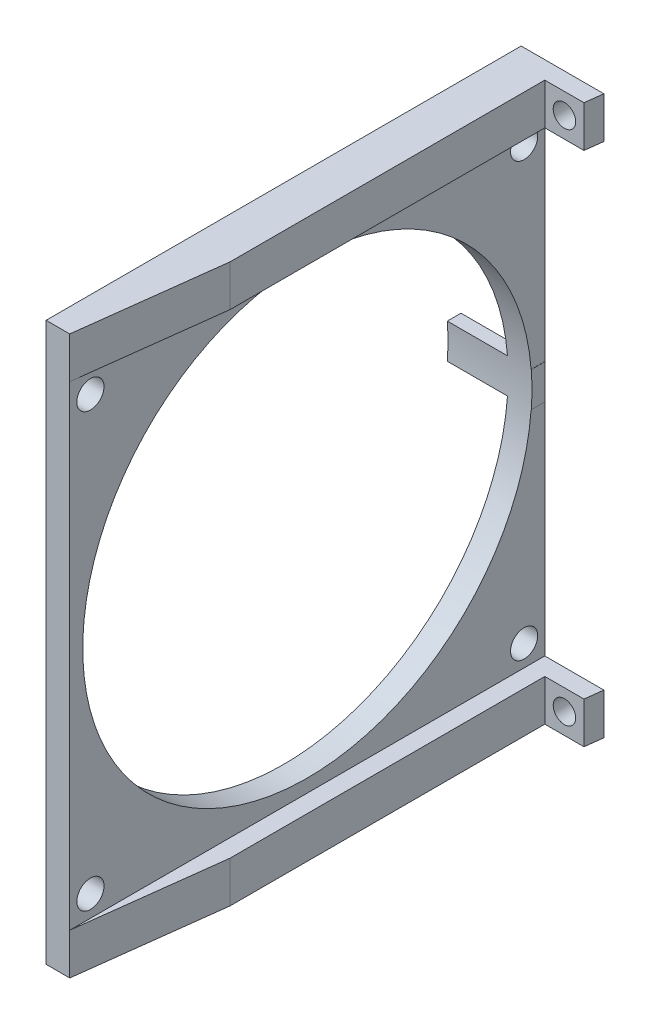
ISO-10303-21;
HEADER;
FILE_DESCRIPTION(('STEP AP214'),'2;1');
FILE_NAME('part.step','',(''),(''),'','','');
FILE_SCHEMA(('AUTOMOTIVE_DESIGN { 1 0 10303 214 1 1 1 1 }'));
ENDSEC;
DATA;
#1=APPLICATION_CONTEXT('core data for automotive mechanical design processes');
#2=APPLICATION_PROTOCOL_DEFINITION('international standard','automotive_design',2000,#1);
#3=PRODUCT_CONTEXT('',#1,'mechanical');
#4=PRODUCT('Part','Part','',(#3));
#5=PRODUCT_RELATED_PRODUCT_CATEGORY('part','',(#4));
#6=PRODUCT_DEFINITION_FORMATION('','',#4);
#7=PRODUCT_DEFINITION_CONTEXT('part definition',#1,'design');
#8=PRODUCT_DEFINITION('design','',#6,#7);
#9=PRODUCT_DEFINITION_SHAPE('','',#8);
#10=(LENGTH_UNIT() NAMED_UNIT(*) SI_UNIT(.MILLI.,.METRE.));
#11=(NAMED_UNIT(*) PLANE_ANGLE_UNIT() SI_UNIT($,.RADIAN.));
#12=(NAMED_UNIT(*) SI_UNIT($,.STERADIAN.) SOLID_ANGLE_UNIT());
#13=UNCERTAINTY_MEASURE_WITH_UNIT(LENGTH_MEASURE(1.E-05),#10,'distance_accuracy_value','');
#14=(GEOMETRIC_REPRESENTATION_CONTEXT(3) GLOBAL_UNCERTAINTY_ASSIGNED_CONTEXT((#13)) GLOBAL_UNIT_ASSIGNED_CONTEXT((#10,
#11,#12)) REPRESENTATION_CONTEXT('',''));
#15=CARTESIAN_POINT('',(0.,0.,0.));
#16=DIRECTION('',(0.,0.,1.));
#17=DIRECTION('',(1.,0.,0.));
#18=AXIS2_PLACEMENT_3D('',#15,#16,#17);
#19=CARTESIAN_POINT('',(4.,-7.60000000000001,0.));
#20=DIRECTION('',(-0.992353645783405,0.,-0.12342707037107));
#21=DIRECTION('',(-0.12342707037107,0.,0.992353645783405));
#22=AXIS2_PLACEMENT_3D('',#19,#20,#21);
#23=PLANE('',#22);
#24=DIRECTION('',(0.12342707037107,0.,-0.992353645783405));
#25=VECTOR('',#24,1.);
#26=CARTESIAN_POINT('',(14.,80.4,-80.4));
#27=LINE('',#26,#25);
#28=CARTESIAN_POINT('',(4.,80.4,0.));
#29=VERTEX_POINT('',#28);
#30=CARTESIAN_POINT('',(7.,80.4,-24.12));
#31=VERTEX_POINT('',#30);
#32=EDGE_CURVE('E201',#29,#31,#27,.T.);
#33=ORIENTED_EDGE('',*,*,#32,.T.);
#34=DIRECTION('',(0.,1.,0.));
#35=VECTOR('',#34,1.);
#36=CARTESIAN_POINT('',(7.,-7.60000000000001,-24.12));
#37=LINE('',#36,#35);
#38=CARTESIAN_POINT('',(7.,87.4,-24.12));
#39=VERTEX_POINT('',#38);
#40=EDGE_CURVE('E187',#31,#39,#37,.T.);
#41=ORIENTED_EDGE('',*,*,#40,.T.);
#42=DIRECTION('',(-0.12342707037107,0.,0.992353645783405));
#43=VECTOR('',#42,1.);
#44=CARTESIAN_POINT('',(4.,87.4,0.));
#45=LINE('',#44,#43);
#46=CARTESIAN_POINT('',(4.,87.4,0.));
#47=VERTEX_POINT('',#46);
#48=EDGE_CURVE('E198',#39,#47,#45,.T.);
#49=ORIENTED_EDGE('',*,*,#48,.T.);
#50=DIRECTION('',(0.,1.,0.));
#51=VECTOR('',#50,1.);
#52=CARTESIAN_POINT('',(4.,-7.60000000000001,0.));
#53=LINE('',#52,#51);
#54=EDGE_CURVE('E212',#29,#47,#53,.T.);
#55=ORIENTED_EDGE('',*,*,#54,.F.);
#56=EDGE_LOOP('',(#33,#41,#49,#55));
#57=FACE_BOUND('',#56,.T.);
#58=ADVANCED_FACE('F39',(#57),#23,.F.);
#59=DIRECTION('',(0.12342707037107,0.,-0.992353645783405));
#60=VECTOR('',#59,1.);
#61=CARTESIAN_POINT('',(14.,-7.,-80.4));
#62=LINE('',#61,#60);
#63=CARTESIAN_POINT('',(4.,-7.,0.));
#64=VERTEX_POINT('',#63);
#65=CARTESIAN_POINT('',(7.,-7.,-24.12));
#66=VERTEX_POINT('',#65);
#67=EDGE_CURVE('E223',#64,#66,#62,.T.);
#68=ORIENTED_EDGE('',*,*,#67,.T.);
#69=CARTESIAN_POINT('',(7.,0.,-24.12));
#70=VERTEX_POINT('',#69);
#71=EDGE_CURVE('E202',#66,#70,#37,.T.);
#72=ORIENTED_EDGE('',*,*,#71,.T.);
#73=DIRECTION('',(-0.12342707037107,0.,0.992353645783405));
#74=VECTOR('',#73,1.);
#75=CARTESIAN_POINT('',(14.,0.,-80.4));
#76=LINE('',#75,#74);
#77=CARTESIAN_POINT('',(4.,0.,0.));
#78=VERTEX_POINT('',#77);
#79=EDGE_CURVE('E226',#70,#78,#76,.T.);
#80=ORIENTED_EDGE('',*,*,#79,.T.);
#81=EDGE_CURVE('E219',#64,#78,#53,.T.);
#82=ORIENTED_EDGE('',*,*,#81,.F.);
#83=EDGE_LOOP('',(#68,#72,#80,#82));
#84=FACE_BOUND('',#83,.T.);
#85=ADVANCED_FACE('F387',(#84),#23,.F.);
#86=CARTESIAN_POINT('',(4.02460480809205,43.1464966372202,-76.4));
#87=DIRECTION('',(0.,-1.,0.));
#88=DIRECTION('',(0.,0.,-1.));
#89=AXIS2_PLACEMENT_3D('',#86,#87,#88);
#90=PLANE('',#89);
#91=DIRECTION('',(-1.,0.,0.));
#92=VECTOR('',#91,1.);
#93=CARTESIAN_POINT('',(8.,43.1464966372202,-78.0855930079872));
#94=LINE('',#93,#92);
#95=CARTESIAN_POINT('',(4.02460480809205,43.1464966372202,-78.0855930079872));
#96=VERTEX_POINT('',#95);
#97=CARTESIAN_POINT('',(4.,43.1464966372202,-78.0855930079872));
#98=VERTEX_POINT('',#97);
#99=EDGE_CURVE('E271',#96,#98,#94,.T.);
#100=ORIENTED_EDGE('',*,*,#99,.F.);
#101=DIRECTION('',(0.,0.,-1.));
#102=VECTOR('',#101,1.);
#103=CARTESIAN_POINT('',(4.02460480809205,43.1464966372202,-76.4));
#104=LINE('',#103,#102);
#105=CARTESIAN_POINT('',(4.02460480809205,43.1464966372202,-80.4));
#106=VERTEX_POINT('',#105);
#107=EDGE_CURVE('E305',#96,#106,#104,.T.);
#108=ORIENTED_EDGE('',*,*,#107,.T.);
#109=DIRECTION('',(-1.,0.,0.));
#110=VECTOR('',#109,1.);
#111=CARTESIAN_POINT('',(4.02460480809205,43.1464966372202,-80.4));
#112=LINE('',#111,#110);
#113=CARTESIAN_POINT('',(4.,43.1464966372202,-80.4));
#114=VERTEX_POINT('',#113);
#115=EDGE_CURVE('E296',#106,#114,#112,.T.);
#116=ORIENTED_EDGE('',*,*,#115,.T.);
#117=DIRECTION('',(0.,0.,1.));
#118=VECTOR('',#117,1.);
#119=CARTESIAN_POINT('',(4.,43.1464966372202,0.));
#120=LINE('',#119,#118);
#121=EDGE_CURVE('E304',#114,#98,#120,.T.);
#122=ORIENTED_EDGE('',*,*,#121,.T.);
#123=EDGE_LOOP('',(#100,#108,#116,#122));
#124=FACE_BOUND('',#123,.T.);
#125=ADVANCED_FACE('F383',(#124),#90,.F.);
#126=CARTESIAN_POINT('',(4.02460480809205,37.2535033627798,-76.4));
#127=DIRECTION('',(0.,-1.,0.));
#128=DIRECTION('',(0.,0.,-1.));
#129=AXIS2_PLACEMENT_3D('',#126,#127,#128);
#130=PLANE('',#129);
#131=DIRECTION('',(0.,0.,-1.));
#132=VECTOR('',#131,1.);
#133=CARTESIAN_POINT('',(4.02460480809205,37.2535033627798,-76.4));
#134=LINE('',#133,#132);
#135=CARTESIAN_POINT('',(4.02460480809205,37.2535033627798,-78.0855930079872));
#136=VERTEX_POINT('',#135);
#137=CARTESIAN_POINT('',(4.02460480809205,37.2535033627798,-80.4));
#138=VERTEX_POINT('',#137);
#139=EDGE_CURVE('E302',#136,#138,#134,.T.);
#140=ORIENTED_EDGE('',*,*,#139,.F.);
#141=DIRECTION('',(-1.,0.,0.));
#142=VECTOR('',#141,1.);
#143=CARTESIAN_POINT('',(8.,37.2535033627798,-78.0855930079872));
#144=LINE('',#143,#142);
#145=CARTESIAN_POINT('',(4.,37.2535033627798,-78.0855930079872));
#146=VERTEX_POINT('',#145);
#147=EDGE_CURVE('E263',#136,#146,#144,.T.);
#148=ORIENTED_EDGE('',*,*,#147,.T.);
#149=DIRECTION('',(0.,0.,1.));
#150=VECTOR('',#149,1.);
#151=CARTESIAN_POINT('',(4.,37.2535033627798,0.));
#152=LINE('',#151,#150);
#153=CARTESIAN_POINT('',(4.,37.2535033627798,-80.4));
#154=VERTEX_POINT('',#153);
#155=EDGE_CURVE('E314',#154,#146,#152,.T.);
#156=ORIENTED_EDGE('',*,*,#155,.F.);
#157=DIRECTION('',(-1.,0.,0.));
#158=VECTOR('',#157,1.);
#159=CARTESIAN_POINT('',(4.02460480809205,37.2535033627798,-80.4));
#160=LINE('',#159,#158);
#161=EDGE_CURVE('E290',#138,#154,#160,.T.);
#162=ORIENTED_EDGE('',*,*,#161,.F.);
#163=EDGE_LOOP('',(#140,#148,#156,#162));
#164=FACE_BOUND('',#163,.T.);
#165=ADVANCED_FACE('F456',(#164),#130,.T.);
#166=DIRECTION('',(0.,0.,-1.));
#167=VECTOR('',#166,1.);
#168=CARTESIAN_POINT('',(0.,37.2535033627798,0.));
#169=LINE('',#168,#167);
#170=CARTESIAN_POINT('',(0.,37.2535033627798,-78.0855930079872));
#171=VERTEX_POINT('',#170);
#172=CARTESIAN_POINT('',(0.,37.2535033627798,-80.4));
#173=VERTEX_POINT('',#172);
#174=EDGE_CURVE('E317',#171,#173,#169,.T.);
#175=ORIENTED_EDGE('',*,*,#174,.F.);
#176=DIRECTION('',(-1.,0.,0.));
#177=VECTOR('',#176,1.);
#178=CARTESIAN_POINT('',(8.,37.2535033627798,-78.0855930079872));
#179=LINE('',#178,#177);
#180=CARTESIAN_POINT('',(-10.1882602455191,37.2535033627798,-78.0855930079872));
#181=VERTEX_POINT('',#180);
#182=EDGE_CURVE('E258',#171,#181,#179,.T.);
#183=ORIENTED_EDGE('',*,*,#182,.T.);
#184=DIRECTION('',(0.,0.,-1.));
#185=VECTOR('',#184,1.);
#186=CARTESIAN_POINT('',(-10.1882602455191,37.2535033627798,-76.4));
#187=LINE('',#186,#185);
#188=CARTESIAN_POINT('',(-10.1882602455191,37.2535033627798,-80.4));
#189=VERTEX_POINT('',#188);
#190=EDGE_CURVE('E301',#181,#189,#187,.T.);
#191=ORIENTED_EDGE('',*,*,#190,.T.);
#192=EDGE_CURVE('E289',#173,#189,#160,.T.);
#193=ORIENTED_EDGE('',*,*,#192,.F.);
#194=EDGE_LOOP('',(#175,#183,#191,#193));
#195=FACE_BOUND('',#194,.T.);
#196=ADVANCED_FACE('F380',(#195),#130,.T.);
#197=DIRECTION('',(-1.,0.,0.));
#198=VECTOR('',#197,1.);
#199=CARTESIAN_POINT('',(8.,43.1464966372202,-78.0855930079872));
#200=LINE('',#199,#198);
#201=CARTESIAN_POINT('',(0.,43.1464966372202,-78.0855930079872));
#202=VERTEX_POINT('',#201);
#203=CARTESIAN_POINT('',(-10.1882602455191,43.1464966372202,-78.0855930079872));
#204=VERTEX_POINT('',#203);
#205=EDGE_CURVE('E252',#202,#204,#200,.T.);
#206=ORIENTED_EDGE('',*,*,#205,.F.);
#207=DIRECTION('',(0.,0.,-1.));
#208=VECTOR('',#207,1.);
#209=CARTESIAN_POINT('',(0.,43.1464966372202,0.));
#210=LINE('',#209,#208);
#211=CARTESIAN_POINT('',(0.,43.1464966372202,-80.4));
#212=VERTEX_POINT('',#211);
#213=EDGE_CURVE('E312',#202,#212,#210,.T.);
#214=ORIENTED_EDGE('',*,*,#213,.T.);
#215=CARTESIAN_POINT('',(-10.1882602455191,43.1464966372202,-80.4));
#216=VERTEX_POINT('',#215);
#217=EDGE_CURVE('E295',#212,#216,#112,.T.);
#218=ORIENTED_EDGE('',*,*,#217,.T.);
#219=DIRECTION('',(0.,0.,-1.));
#220=VECTOR('',#219,1.);
#221=CARTESIAN_POINT('',(-10.1882602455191,43.1464966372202,-76.4));
#222=LINE('',#221,#220);
#223=EDGE_CURVE('E307',#204,#216,#222,.T.);
#224=ORIENTED_EDGE('',*,*,#223,.F.);
#225=EDGE_LOOP('',(#206,#214,#218,#224));
#226=FACE_BOUND('',#225,.T.);
#227=ADVANCED_FACE('F373',(#226),#90,.F.);
#228=CARTESIAN_POINT('',(0.,80.4,0.));
#229=DIRECTION('',(1.,0.,0.));
#230=DIRECTION('',(0.,0.,-1.));
#231=AXIS2_PLACEMENT_3D('',#228,#229,#230);
#232=PLANE('',#231);
#233=CARTESIAN_POINT('',(0.,3.60000000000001,-3.5));
#234=DIRECTION('',(1.,0.,0.));
#235=DIRECTION('',(0.,0.,-1.));
#236=AXIS2_PLACEMENT_3D('',#233,#234,#235);
#237=CIRCLE('',#236,2.3);
#238=CARTESIAN_POINT('',(0.,3.60000000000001,-5.8));
#239=VERTEX_POINT('',#238);
#240=EDGE_CURVE('E286',#239,#239,#237,.F.);
#241=ORIENTED_EDGE('',*,*,#240,.F.);
#242=EDGE_LOOP('',(#241));
#243=FACE_BOUND('',#242,.T.);
#244=CARTESIAN_POINT('',(0.,3.59999999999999,-76.9));
#245=DIRECTION('',(1.,0.,0.));
#246=DIRECTION('',(0.,0.,-1.));
#247=AXIS2_PLACEMENT_3D('',#244,#245,#246);
#248=CIRCLE('',#247,2.30000000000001);
#249=CARTESIAN_POINT('',(0.,3.59999999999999,-79.2));
#250=VERTEX_POINT('',#249);
#251=EDGE_CURVE('E282',#250,#250,#248,.F.);
#252=ORIENTED_EDGE('',*,*,#251,.F.);
#253=EDGE_LOOP('',(#252));
#254=FACE_BOUND('',#253,.T.);
#255=CARTESIAN_POINT('',(0.,40.2,-40.2));
#256=DIRECTION('',(1.,0.,0.));
#257=DIRECTION('',(0.,0.,-1.));
#258=AXIS2_PLACEMENT_3D('',#255,#256,#257);
#259=CIRCLE('',#258,38.);
#260=EDGE_CURVE('E261',#171,#202,#259,.F.);
#261=ORIENTED_EDGE('',*,*,#260,.F.);
#262=ORIENTED_EDGE('',*,*,#174,.T.);
#263=DIRECTION('',(0.,-1.,0.));
#264=VECTOR('',#263,1.);
#265=CARTESIAN_POINT('',(0.,80.4,-80.4));
#266=LINE('',#265,#264);
#267=CARTESIAN_POINT('',(0.,-7.,-80.4));
#268=VERTEX_POINT('',#267);
#269=EDGE_CURVE('E323',#173,#268,#266,.T.);
#270=ORIENTED_EDGE('',*,*,#269,.T.);
#271=DIRECTION('',(0.,0.,1.));
#272=VECTOR('',#271,1.);
#273=CARTESIAN_POINT('',(0.,-7.,-80.4));
#274=LINE('',#273,#272);
#275=CARTESIAN_POINT('',(0.,-7.,0.));
#276=VERTEX_POINT('',#275);
#277=EDGE_CURVE('E241',#268,#276,#274,.T.);
#278=ORIENTED_EDGE('',*,*,#277,.T.);
#279=DIRECTION('',(0.,-1.,0.));
#280=VECTOR('',#279,1.);
#281=CARTESIAN_POINT('',(0.,80.4,0.));
#282=LINE('',#281,#280);
#283=CARTESIAN_POINT('',(0.,87.4,0.));
#284=VERTEX_POINT('',#283);
#285=EDGE_CURVE('E48',#284,#276,#282,.T.);
#286=ORIENTED_EDGE('',*,*,#285,.F.);
#287=DIRECTION('',(0.,0.,-1.));
#288=VECTOR('',#287,1.);
#289=CARTESIAN_POINT('',(0.,87.4,-80.4));
#290=LINE('',#289,#288);
#291=CARTESIAN_POINT('',(0.,87.4,-80.4));
#292=VERTEX_POINT('',#291);
#293=EDGE_CURVE('E238',#284,#292,#290,.T.);
#294=ORIENTED_EDGE('',*,*,#293,.T.);
#295=EDGE_CURVE('E326',#292,#212,#266,.T.);
#296=ORIENTED_EDGE('',*,*,#295,.T.);
#297=ORIENTED_EDGE('',*,*,#213,.F.);
#298=EDGE_LOOP('',(#261,#262,#270,#278,#286,#294,#296,#297));
#299=FACE_BOUND('',#298,.T.);
#300=CARTESIAN_POINT('',(0.,76.8,-76.9));
#301=DIRECTION('',(1.,0.,0.));
#302=DIRECTION('',(0.,0.,-1.));
#303=AXIS2_PLACEMENT_3D('',#300,#301,#302);
#304=CIRCLE('',#303,2.30000000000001);
#305=CARTESIAN_POINT('',(0.,76.8,-79.2));
#306=VERTEX_POINT('',#305);
#307=EDGE_CURVE('E278',#306,#306,#304,.F.);
#308=ORIENTED_EDGE('',*,*,#307,.F.);
#309=EDGE_LOOP('',(#308));
#310=FACE_BOUND('',#309,.T.);
#311=CARTESIAN_POINT('',(0.,76.8,-3.5));
#312=DIRECTION('',(1.,0.,0.));
#313=DIRECTION('',(0.,0.,-1.));
#314=AXIS2_PLACEMENT_3D('',#311,#312,#313);
#315=CIRCLE('',#314,2.3);
#316=CARTESIAN_POINT('',(0.,76.8,-5.8));
#317=VERTEX_POINT('',#316);
#318=EDGE_CURVE('E274',#317,#317,#315,.F.);
#319=ORIENTED_EDGE('',*,*,#318,.F.);
#320=EDGE_LOOP('',(#319));
#321=FACE_BOUND('',#320,.T.);
#322=ADVANCED_FACE('F41',(#243,#254,#299,#310,#321),#232,.F.);
#323=CARTESIAN_POINT('',(0.,80.4,0.));
#324=DIRECTION('',(0.,0.,-1.));
#325=DIRECTION('',(-1.,0.,0.));
#326=AXIS2_PLACEMENT_3D('',#323,#324,#325);
#327=PLANE('',#326);
#328=DIRECTION('',(-1.,0.,0.));
#329=VECTOR('',#328,1.);
#330=CARTESIAN_POINT('',(14.,-7.,0.));
#331=LINE('',#330,#329);
#332=EDGE_CURVE('E253',#64,#276,#331,.T.);
#333=ORIENTED_EDGE('',*,*,#332,.F.);
#334=ORIENTED_EDGE('',*,*,#81,.T.);
#335=DIRECTION('',(0.,-1.,0.));
#336=VECTOR('',#335,1.);
#337=CARTESIAN_POINT('',(4.,80.4,0.));
#338=LINE('',#337,#336);
#339=EDGE_CURVE('E333',#29,#78,#338,.T.);
#340=ORIENTED_EDGE('',*,*,#339,.F.);
#341=ORIENTED_EDGE('',*,*,#54,.T.);
#342=DIRECTION('',(-1.,0.,0.));
#343=VECTOR('',#342,1.);
#344=CARTESIAN_POINT('',(14.,87.4,0.));
#345=LINE('',#344,#343);
#346=EDGE_CURVE('E207',#47,#284,#345,.T.);
#347=ORIENTED_EDGE('',*,*,#346,.T.);
#348=ORIENTED_EDGE('',*,*,#285,.T.);
#349=EDGE_LOOP('',(#333,#334,#340,#341,#347,#348));
#350=FACE_BOUND('',#349,.T.);
#351=ADVANCED_FACE('F353',(#350),#327,.F.);
#352=CARTESIAN_POINT('',(4.,80.4,0.));
#353=DIRECTION('',(-1.,0.,0.));
#354=DIRECTION('',(0.,0.,1.));
#355=AXIS2_PLACEMENT_3D('',#352,#353,#354);
#356=PLANE('',#355);
#357=CARTESIAN_POINT('',(4.,3.60000000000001,-3.5));
#358=DIRECTION('',(-1.,0.,0.));
#359=DIRECTION('',(0.,0.,1.));
#360=AXIS2_PLACEMENT_3D('',#357,#358,#359);
#361=CIRCLE('',#360,2.3);
#362=CARTESIAN_POINT('',(4.,3.60000000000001,-1.2));
#363=VERTEX_POINT('',#362);
#364=EDGE_CURVE('E285',#363,#363,#361,.F.);
#365=ORIENTED_EDGE('',*,*,#364,.F.);
#366=EDGE_LOOP('',(#365));
#367=FACE_BOUND('',#366,.T.);
#368=CARTESIAN_POINT('',(4.,3.59999999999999,-76.9));
#369=DIRECTION('',(-1.,0.,0.));
#370=DIRECTION('',(0.,0.,1.));
#371=AXIS2_PLACEMENT_3D('',#368,#369,#370);
#372=CIRCLE('',#371,2.30000000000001);
#373=CARTESIAN_POINT('',(4.,3.59999999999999,-74.6));
#374=VERTEX_POINT('',#373);
#375=EDGE_CURVE('E281',#374,#374,#372,.F.);
#376=ORIENTED_EDGE('',*,*,#375,.F.);
#377=EDGE_LOOP('',(#376));
#378=FACE_BOUND('',#377,.T.);
#379=CARTESIAN_POINT('',(4.,40.2,-40.2));
#380=DIRECTION('',(-1.,0.,0.));
#381=DIRECTION('',(0.,0.,1.));
#382=AXIS2_PLACEMENT_3D('',#379,#380,#381);
#383=CIRCLE('',#382,38.);
#384=EDGE_CURVE('E269',#98,#146,#383,.F.);
#385=ORIENTED_EDGE('',*,*,#384,.F.);
#386=ORIENTED_EDGE('',*,*,#121,.F.);
#387=DIRECTION('',(0.,-1.,0.));
#388=VECTOR('',#387,1.);
#389=CARTESIAN_POINT('',(4.,80.4,-80.4));
#390=LINE('',#389,#388);
#391=CARTESIAN_POINT('',(4.,80.4,-80.4));
#392=VERTEX_POINT('',#391);
#393=EDGE_CURVE('E330',#392,#114,#390,.T.);
#394=ORIENTED_EDGE('',*,*,#393,.F.);
#395=DIRECTION('',(0.,0.,-1.));
#396=VECTOR('',#395,1.);
#397=CARTESIAN_POINT('',(4.,80.4,0.));
#398=LINE('',#397,#396);
#399=EDGE_CURVE('E320',#29,#392,#398,.T.);
#400=ORIENTED_EDGE('',*,*,#399,.F.);
#401=ORIENTED_EDGE('',*,*,#339,.T.);
#402=DIRECTION('',(0.,0.,-1.));
#403=VECTOR('',#402,1.);
#404=CARTESIAN_POINT('',(4.,0.,0.));
#405=LINE('',#404,#403);
#406=CARTESIAN_POINT('',(4.,0.,-80.4));
#407=VERTEX_POINT('',#406);
#408=EDGE_CURVE('E319',#78,#407,#405,.T.);
#409=ORIENTED_EDGE('',*,*,#408,.T.);
#410=EDGE_CURVE('E329',#154,#407,#390,.T.);
#411=ORIENTED_EDGE('',*,*,#410,.F.);
#412=ORIENTED_EDGE('',*,*,#155,.T.);
#413=EDGE_LOOP('',(#385,#386,#394,#400,#401,#409,#411,#412));
#414=FACE_BOUND('',#413,.T.);
#415=CARTESIAN_POINT('',(4.,76.8,-76.9));
#416=DIRECTION('',(-1.,0.,0.));
#417=DIRECTION('',(0.,0.,1.));
#418=AXIS2_PLACEMENT_3D('',#415,#416,#417);
#419=CIRCLE('',#418,2.30000000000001);
#420=CARTESIAN_POINT('',(4.,76.8,-74.6));
#421=VERTEX_POINT('',#420);
#422=EDGE_CURVE('E277',#421,#421,#419,.F.);
#423=ORIENTED_EDGE('',*,*,#422,.F.);
#424=EDGE_LOOP('',(#423));
#425=FACE_BOUND('',#424,.T.);
#426=CARTESIAN_POINT('',(4.,76.8,-3.5));
#427=DIRECTION('',(-1.,0.,0.));
#428=DIRECTION('',(0.,0.,1.));
#429=AXIS2_PLACEMENT_3D('',#426,#427,#428);
#430=CIRCLE('',#429,2.3);
#431=CARTESIAN_POINT('',(4.,76.8,-1.2));
#432=VERTEX_POINT('',#431);
#433=EDGE_CURVE('E273',#432,#432,#430,.F.);
#434=ORIENTED_EDGE('',*,*,#433,.F.);
#435=EDGE_LOOP('',(#434));
#436=FACE_BOUND('',#435,.T.);
#437=ADVANCED_FACE('F349',(#367,#378,#414,#425,#436),#356,.F.);
#438=CARTESIAN_POINT('',(0.,80.4,-80.4));
#439=DIRECTION('',(0.,0.,1.));
#440=DIRECTION('',(1.,0.,0.));
#441=AXIS2_PLACEMENT_3D('',#438,#439,#440);
#442=PLANE('',#441);
#443=CARTESIAN_POINT('',(10.3209312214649,83.9,-80.4));
#444=DIRECTION('',(0.,0.,-1.));
#445=DIRECTION('',(-1.,0.,0.));
#446=AXIS2_PLACEMENT_3D('',#443,#444,#445);
#447=CIRCLE('',#446,1.9);
#448=CARTESIAN_POINT('',(8.42093122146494,83.9,-80.4));
#449=VERTEX_POINT('',#448);
#450=EDGE_CURVE('E209',#449,#449,#447,.T.);
#451=ORIENTED_EDGE('',*,*,#450,.F.);
#452=EDGE_LOOP('',(#451));
#453=FACE_BOUND('',#452,.T.);
#454=CARTESIAN_POINT('',(10.3209312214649,-3.5,-80.4));
#455=DIRECTION('',(0.,0.,-1.));
#456=DIRECTION('',(1.,0.,0.));
#457=AXIS2_PLACEMENT_3D('',#454,#455,#456);
#458=CIRCLE('',#457,1.9);
#459=CARTESIAN_POINT('',(12.2209312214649,-3.5,-80.4));
#460=VERTEX_POINT('',#459);
#461=EDGE_CURVE('E214',#460,#460,#458,.T.);
#462=ORIENTED_EDGE('',*,*,#461,.F.);
#463=EDGE_LOOP('',(#462));
#464=FACE_BOUND('',#463,.T.);
#465=ORIENTED_EDGE('',*,*,#269,.F.);
#466=ORIENTED_EDGE('',*,*,#192,.T.);
#467=DIRECTION('',(0.,-1.,0.));
#468=VECTOR('',#467,1.);
#469=CARTESIAN_POINT('',(-10.1882602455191,43.1464966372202,-80.4));
#470=LINE('',#469,#468);
#471=EDGE_CURVE('E292',#216,#189,#470,.T.);
#472=ORIENTED_EDGE('',*,*,#471,.F.);
#473=ORIENTED_EDGE('',*,*,#217,.F.);
#474=ORIENTED_EDGE('',*,*,#295,.F.);
#475=DIRECTION('',(-1.,0.,0.));
#476=VECTOR('',#475,1.);
#477=CARTESIAN_POINT('',(14.,87.4,-80.4));
#478=LINE('',#477,#476);
#479=CARTESIAN_POINT('',(14.,87.4,-80.4));
#480=VERTEX_POINT('',#479);
#481=EDGE_CURVE('E230',#480,#292,#478,.T.);
#482=ORIENTED_EDGE('',*,*,#481,.F.);
#483=DIRECTION('',(0.,-1.,0.));
#484=VECTOR('',#483,1.);
#485=CARTESIAN_POINT('',(14.,80.4,-80.4));
#486=LINE('',#485,#484);
#487=CARTESIAN_POINT('',(14.,80.4,-80.4));
#488=VERTEX_POINT('',#487);
#489=EDGE_CURVE('E234',#480,#488,#486,.T.);
#490=ORIENTED_EDGE('',*,*,#489,.T.);
#491=DIRECTION('',(-1.,0.,0.));
#492=VECTOR('',#491,1.);
#493=CARTESIAN_POINT('',(14.,80.4,-80.4));
#494=LINE('',#493,#492);
#495=EDGE_CURVE('E231',#488,#392,#494,.T.);
#496=ORIENTED_EDGE('',*,*,#495,.T.);
#497=ORIENTED_EDGE('',*,*,#393,.T.);
#498=ORIENTED_EDGE('',*,*,#115,.F.);
#499=DIRECTION('',(0.,-1.,0.));
#500=VECTOR('',#499,1.);
#501=CARTESIAN_POINT('',(4.02460480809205,43.1464966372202,-80.4));
#502=LINE('',#501,#500);
#503=EDGE_CURVE('E298',#106,#138,#502,.T.);
#504=ORIENTED_EDGE('',*,*,#503,.T.);
#505=ORIENTED_EDGE('',*,*,#161,.T.);
#506=ORIENTED_EDGE('',*,*,#410,.T.);
#507=DIRECTION('',(-1.,0.,0.));
#508=VECTOR('',#507,1.);
#509=CARTESIAN_POINT('',(14.,0.,-80.4));
#510=LINE('',#509,#508);
#511=CARTESIAN_POINT('',(14.,0.,-80.4));
#512=VERTEX_POINT('',#511);
#513=EDGE_CURVE('E250',#512,#407,#510,.T.);
#514=ORIENTED_EDGE('',*,*,#513,.F.);
#515=DIRECTION('',(0.,-1.,0.));
#516=VECTOR('',#515,1.);
#517=CARTESIAN_POINT('',(14.,0.,-80.4));
#518=LINE('',#517,#516);
#519=CARTESIAN_POINT('',(14.,-7.,-80.4));
#520=VERTEX_POINT('',#519);
#521=EDGE_CURVE('E244',#512,#520,#518,.T.);
#522=ORIENTED_EDGE('',*,*,#521,.T.);
#523=DIRECTION('',(-1.,0.,0.));
#524=VECTOR('',#523,1.);
#525=CARTESIAN_POINT('',(14.,-7.,-80.4));
#526=LINE('',#525,#524);
#527=EDGE_CURVE('E247',#520,#268,#526,.T.);
#528=ORIENTED_EDGE('',*,*,#527,.T.);
#529=EDGE_LOOP('',(#465,#466,#472,#473,#474,#482,#490,#496,#497,#498,#504,#505,#506,#514,#522,#528));
#530=FACE_BOUND('',#529,.T.);
#531=ADVANCED_FACE('F352',(#453,#464,#530),#442,.F.);
#532=CARTESIAN_POINT('',(4.02460480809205,43.1464966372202,-76.4));
#533=DIRECTION('',(1.,0.,0.));
#534=DIRECTION('',(0.,0.,-1.));
#535=AXIS2_PLACEMENT_3D('',#532,#533,#534);
#536=PLANE('',#535);
#537=ORIENTED_EDGE('',*,*,#107,.F.);
#538=CARTESIAN_POINT('',(4.02460480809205,40.2,-40.2));
#539=DIRECTION('',(1.,0.,0.));
#540=DIRECTION('',(0.,0.,-1.));
#541=AXIS2_PLACEMENT_3D('',#538,#539,#540);
#542=CIRCLE('',#541,38.);
#543=EDGE_CURVE('E266',#96,#136,#542,.F.);
#544=ORIENTED_EDGE('',*,*,#543,.T.);
#545=ORIENTED_EDGE('',*,*,#139,.T.);
#546=ORIENTED_EDGE('',*,*,#503,.F.);
#547=EDGE_LOOP('',(#537,#544,#545,#546));
#548=FACE_BOUND('',#547,.T.);
#549=ADVANCED_FACE('F445',(#548),#536,.T.);
#550=CARTESIAN_POINT('',(-10.1882602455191,43.1464966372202,-76.4));
#551=DIRECTION('',(1.,0.,0.));
#552=DIRECTION('',(0.,0.,-1.));
#553=AXIS2_PLACEMENT_3D('',#550,#551,#552);
#554=PLANE('',#553);
#555=CARTESIAN_POINT('',(-10.1882602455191,40.2,-40.2));
#556=DIRECTION('',(1.,0.,0.));
#557=DIRECTION('',(0.,0.,-1.));
#558=AXIS2_PLACEMENT_3D('',#555,#556,#557);
#559=CIRCLE('',#558,38.);
#560=EDGE_CURVE('E11',#204,#181,#559,.F.);
#561=ORIENTED_EDGE('',*,*,#560,.F.);
#562=ORIENTED_EDGE('',*,*,#223,.T.);
#563=ORIENTED_EDGE('',*,*,#471,.T.);
#564=ORIENTED_EDGE('',*,*,#190,.F.);
#565=EDGE_LOOP('',(#561,#562,#563,#564));
#566=FACE_BOUND('',#565,.T.);
#567=ADVANCED_FACE('F451',(#566),#554,.F.);
#568=CARTESIAN_POINT('',(8.,40.2,-40.2));
#569=DIRECTION('',(-1.,0.,0.));
#570=DIRECTION('',(0.,0.,1.));
#571=AXIS2_PLACEMENT_3D('',#568,#569,#570);
#572=CYLINDRICAL_SURFACE('',#571,38.);
#573=ORIENTED_EDGE('',*,*,#260,.T.);
#574=ORIENTED_EDGE('',*,*,#205,.T.);
#575=ORIENTED_EDGE('',*,*,#560,.T.);
#576=ORIENTED_EDGE('',*,*,#182,.F.);
#577=EDGE_LOOP('',(#573,#574,#575,#576));
#578=FACE_BOUND('',#577,.T.);
#579=ORIENTED_EDGE('',*,*,#99,.T.);
#580=ORIENTED_EDGE('',*,*,#384,.T.);
#581=ORIENTED_EDGE('',*,*,#147,.F.);
#582=ORIENTED_EDGE('',*,*,#543,.F.);
#583=EDGE_LOOP('',(#579,#580,#581,#582));
#584=FACE_BOUND('',#583,.T.);
#585=ADVANCED_FACE('F368',(#578,#584),#572,.F.);
#586=CARTESIAN_POINT('',(8.,76.8,-3.5));
#587=DIRECTION('',(-1.,0.,0.));
#588=DIRECTION('',(0.,0.,1.));
#589=AXIS2_PLACEMENT_3D('',#586,#587,#588);
#590=CYLINDRICAL_SURFACE('',#589,2.3);
#591=ORIENTED_EDGE('',*,*,#433,.T.);
#592=EDGE_LOOP('',(#591));
#593=FACE_BOUND('',#592,.T.);
#594=ORIENTED_EDGE('',*,*,#318,.T.);
#595=EDGE_LOOP('',(#594));
#596=FACE_BOUND('',#595,.T.);
#597=ADVANCED_FACE('F364',(#593,#596),#590,.F.);
#598=CARTESIAN_POINT('',(8.,76.8,-76.9));
#599=DIRECTION('',(-1.,0.,0.));
#600=DIRECTION('',(0.,0.,1.));
#601=AXIS2_PLACEMENT_3D('',#598,#599,#600);
#602=CYLINDRICAL_SURFACE('',#601,2.30000000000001);
#603=ORIENTED_EDGE('',*,*,#422,.T.);
#604=EDGE_LOOP('',(#603));
#605=FACE_BOUND('',#604,.T.);
#606=ORIENTED_EDGE('',*,*,#307,.T.);
#607=EDGE_LOOP('',(#606));
#608=FACE_BOUND('',#607,.T.);
#609=ADVANCED_FACE('F367',(#605,#608),#602,.F.);
#610=CARTESIAN_POINT('',(8.,3.59999999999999,-76.9));
#611=DIRECTION('',(-1.,0.,0.));
#612=DIRECTION('',(0.,0.,1.));
#613=AXIS2_PLACEMENT_3D('',#610,#611,#612);
#614=CYLINDRICAL_SURFACE('',#613,2.30000000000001);
#615=ORIENTED_EDGE('',*,*,#375,.T.);
#616=EDGE_LOOP('',(#615));
#617=FACE_BOUND('',#616,.T.);
#618=ORIENTED_EDGE('',*,*,#251,.T.);
#619=EDGE_LOOP('',(#618));
#620=FACE_BOUND('',#619,.T.);
#621=ADVANCED_FACE('F465',(#617,#620),#614,.F.);
#622=CARTESIAN_POINT('',(8.,3.60000000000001,-3.5));
#623=DIRECTION('',(-1.,0.,0.));
#624=DIRECTION('',(0.,0.,1.));
#625=AXIS2_PLACEMENT_3D('',#622,#623,#624);
#626=CYLINDRICAL_SURFACE('',#625,2.3);
#627=ORIENTED_EDGE('',*,*,#364,.T.);
#628=EDGE_LOOP('',(#627));
#629=FACE_BOUND('',#628,.T.);
#630=ORIENTED_EDGE('',*,*,#240,.T.);
#631=EDGE_LOOP('',(#630));
#632=FACE_BOUND('',#631,.T.);
#633=ADVANCED_FACE('F346',(#629,#632),#626,.F.);
#634=CARTESIAN_POINT('',(14.,0.,-80.4));
#635=DIRECTION('',(0.,1.,0.));
#636=DIRECTION('',(0.,0.,1.));
#637=AXIS2_PLACEMENT_3D('',#634,#635,#636);
#638=PLANE('',#637);
#639=DIRECTION('',(0.,0.,1.));
#640=VECTOR('',#639,1.);
#641=CARTESIAN_POINT('',(7.,0.,-80.4));
#642=LINE('',#641,#640);
#643=CARTESIAN_POINT('',(7.,0.,-77.4));
#644=VERTEX_POINT('',#643);
#645=EDGE_CURVE('E431',#644,#70,#642,.T.);
#646=ORIENTED_EDGE('',*,*,#645,.F.);
#647=DIRECTION('',(-1.,0.,0.));
#648=VECTOR('',#647,1.);
#649=CARTESIAN_POINT('',(14.,0.,-77.4));
#650=LINE('',#649,#648);
#651=CARTESIAN_POINT('',(13.6268656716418,0.,-77.4));
#652=VERTEX_POINT('',#651);
#653=EDGE_CURVE('E429',#652,#644,#650,.T.);
#654=ORIENTED_EDGE('',*,*,#653,.F.);
#655=EDGE_CURVE('E227',#512,#652,#76,.T.);
#656=ORIENTED_EDGE('',*,*,#655,.F.);
#657=ORIENTED_EDGE('',*,*,#513,.T.);
#658=ORIENTED_EDGE('',*,*,#408,.F.);
#659=ORIENTED_EDGE('',*,*,#79,.F.);
#660=EDGE_LOOP('',(#646,#654,#656,#657,#658,#659));
#661=FACE_BOUND('',#660,.T.);
#662=ADVANCED_FACE('F471',(#661),#638,.T.);
#663=CARTESIAN_POINT('',(14.,-7.,-80.4));
#664=DIRECTION('',(0.,-1.,0.));
#665=DIRECTION('',(0.,0.,-1.));
#666=AXIS2_PLACEMENT_3D('',#663,#664,#665);
#667=PLANE('',#666);
#668=DIRECTION('',(0.,0.,-1.));
#669=VECTOR('',#668,1.);
#670=CARTESIAN_POINT('',(7.,-7.,-80.4));
#671=LINE('',#670,#669);
#672=CARTESIAN_POINT('',(7.,-7.,-77.4));
#673=VERTEX_POINT('',#672);
#674=EDGE_CURVE('E428',#66,#673,#671,.T.);
#675=ORIENTED_EDGE('',*,*,#674,.F.);
#676=ORIENTED_EDGE('',*,*,#67,.F.);
#677=ORIENTED_EDGE('',*,*,#332,.T.);
#678=ORIENTED_EDGE('',*,*,#277,.F.);
#679=ORIENTED_EDGE('',*,*,#527,.F.);
#680=CARTESIAN_POINT('',(13.6268656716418,-7.,-77.4));
#681=VERTEX_POINT('',#680);
#682=EDGE_CURVE('E221',#681,#520,#62,.T.);
#683=ORIENTED_EDGE('',*,*,#682,.F.);
#684=DIRECTION('',(1.,0.,0.));
#685=VECTOR('',#684,1.);
#686=CARTESIAN_POINT('',(14.,-7.,-77.4));
#687=LINE('',#686,#685);
#688=EDGE_CURVE('E64',#673,#681,#687,.T.);
#689=ORIENTED_EDGE('',*,*,#688,.F.);
#690=EDGE_LOOP('',(#675,#676,#677,#678,#679,#683,#689));
#691=FACE_BOUND('',#690,.T.);
#692=ADVANCED_FACE('F478',(#691),#667,.T.);
#693=CARTESIAN_POINT('',(14.,87.4,-80.4));
#694=DIRECTION('',(0.,1.,0.));
#695=DIRECTION('',(0.,0.,1.));
#696=AXIS2_PLACEMENT_3D('',#693,#694,#695);
#697=PLANE('',#696);
#698=DIRECTION('',(0.,0.,1.));
#699=VECTOR('',#698,1.);
#700=CARTESIAN_POINT('',(7.,87.4,-77.4));
#701=LINE('',#700,#699);
#702=CARTESIAN_POINT('',(7.,87.4,-77.4));
#703=VERTEX_POINT('',#702);
#704=EDGE_CURVE('E184',#703,#39,#701,.T.);
#705=ORIENTED_EDGE('',*,*,#704,.F.);
#706=DIRECTION('',(-1.,0.,0.));
#707=VECTOR('',#706,1.);
#708=CARTESIAN_POINT('',(7.,87.4,-77.4));
#709=LINE('',#708,#707);
#710=CARTESIAN_POINT('',(13.6268656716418,87.4,-77.4));
#711=VERTEX_POINT('',#710);
#712=EDGE_CURVE('E194',#711,#703,#709,.T.);
#713=ORIENTED_EDGE('',*,*,#712,.F.);
#714=EDGE_CURVE('E208',#480,#711,#45,.T.);
#715=ORIENTED_EDGE('',*,*,#714,.F.);
#716=ORIENTED_EDGE('',*,*,#481,.T.);
#717=ORIENTED_EDGE('',*,*,#293,.F.);
#718=ORIENTED_EDGE('',*,*,#346,.F.);
#719=ORIENTED_EDGE('',*,*,#48,.F.);
#720=EDGE_LOOP('',(#705,#713,#715,#716,#717,#718,#719));
#721=FACE_BOUND('',#720,.T.);
#722=ADVANCED_FACE('F205',(#721),#697,.T.);
#723=CARTESIAN_POINT('',(14.,80.4,-80.4));
#724=DIRECTION('',(0.,-1.,0.));
#725=DIRECTION('',(0.,0.,-1.));
#726=AXIS2_PLACEMENT_3D('',#723,#724,#725);
#727=PLANE('',#726);
#728=DIRECTION('',(0.,0.,-1.));
#729=VECTOR('',#728,1.);
#730=CARTESIAN_POINT('',(7.,80.4,-80.4));
#731=LINE('',#730,#729);
#732=CARTESIAN_POINT('',(7.,80.4,-77.4));
#733=VERTEX_POINT('',#732);
#734=EDGE_CURVE('E427',#31,#733,#731,.T.);
#735=ORIENTED_EDGE('',*,*,#734,.F.);
#736=ORIENTED_EDGE('',*,*,#32,.F.);
#737=ORIENTED_EDGE('',*,*,#399,.T.);
#738=ORIENTED_EDGE('',*,*,#495,.F.);
#739=CARTESIAN_POINT('',(13.6268656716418,80.4,-77.4));
#740=VERTEX_POINT('',#739);
#741=EDGE_CURVE('E222',#740,#488,#27,.T.);
#742=ORIENTED_EDGE('',*,*,#741,.F.);
#743=DIRECTION('',(1.,0.,0.));
#744=VECTOR('',#743,1.);
#745=CARTESIAN_POINT('',(14.,80.4,-77.4));
#746=LINE('',#745,#744);
#747=EDGE_CURVE('E56',#733,#740,#746,.T.);
#748=ORIENTED_EDGE('',*,*,#747,.F.);
#749=EDGE_LOOP('',(#735,#736,#737,#738,#742,#748));
#750=FACE_BOUND('',#749,.T.);
#751=ADVANCED_FACE('F398',(#750),#727,.T.);
#752=ORIENTED_EDGE('',*,*,#714,.T.);
#753=DIRECTION('',(0.,1.,0.));
#754=VECTOR('',#753,1.);
#755=CARTESIAN_POINT('',(13.6268656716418,-7.60000000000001,-77.4));
#756=LINE('',#755,#754);
#757=EDGE_CURVE('E408',#740,#711,#756,.T.);
#758=ORIENTED_EDGE('',*,*,#757,.F.);
#759=ORIENTED_EDGE('',*,*,#741,.T.);
#760=ORIENTED_EDGE('',*,*,#489,.F.);
#761=EDGE_LOOP('',(#752,#758,#759,#760));
#762=FACE_BOUND('',#761,.T.);
#763=ADVANCED_FACE('F389',(#762),#23,.F.);
#764=ORIENTED_EDGE('',*,*,#655,.T.);
#765=EDGE_CURVE('E770',#681,#652,#756,.T.);
#766=ORIENTED_EDGE('',*,*,#765,.F.);
#767=ORIENTED_EDGE('',*,*,#682,.T.);
#768=ORIENTED_EDGE('',*,*,#521,.F.);
#769=EDGE_LOOP('',(#764,#766,#767,#768));
#770=FACE_BOUND('',#769,.T.);
#771=ADVANCED_FACE('F394',(#770),#23,.F.);
#772=CARTESIAN_POINT('',(10.3209312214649,-3.5,14.6));
#773=DIRECTION('',(0.,0.,-1.));
#774=DIRECTION('',(-1.,0.,0.));
#775=AXIS2_PLACEMENT_3D('',#772,#773,#774);
#776=CYLINDRICAL_SURFACE('',#775,1.9);
#777=CARTESIAN_POINT('',(10.3209312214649,-3.5,-77.4));
#778=DIRECTION('',(0.,0.,-1.));
#779=DIRECTION('',(-1.,0.,0.));
#780=AXIS2_PLACEMENT_3D('',#777,#778,#779);
#781=CIRCLE('',#780,1.9);
#782=CARTESIAN_POINT('',(8.42093122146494,-3.5,-77.4));
#783=VERTEX_POINT('',#782);
#784=EDGE_CURVE('E771',#783,#783,#781,.F.);
#785=ORIENTED_EDGE('',*,*,#784,.T.);
#786=EDGE_LOOP('',(#785));
#787=FACE_BOUND('',#786,.T.);
#788=ORIENTED_EDGE('',*,*,#461,.T.);
#789=EDGE_LOOP('',(#788));
#790=FACE_BOUND('',#789,.T.);
#791=ADVANCED_FACE('F404',(#787,#790),#776,.F.);
#792=CARTESIAN_POINT('',(10.3209312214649,83.9,14.6));
#793=DIRECTION('',(0.,0.,-1.));
#794=DIRECTION('',(-1.,0.,0.));
#795=AXIS2_PLACEMENT_3D('',#792,#793,#794);
#796=CYLINDRICAL_SURFACE('',#795,1.9);
#797=CARTESIAN_POINT('',(10.3209312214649,83.9,-77.4));
#798=DIRECTION('',(0.,0.,-1.));
#799=DIRECTION('',(-1.,0.,0.));
#800=AXIS2_PLACEMENT_3D('',#797,#798,#799);
#801=CIRCLE('',#800,1.9);
#802=CARTESIAN_POINT('',(8.42093122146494,83.9,-77.4));
#803=VERTEX_POINT('',#802);
#804=EDGE_CURVE('E43',#803,#803,#801,.F.);
#805=ORIENTED_EDGE('',*,*,#804,.T.);
#806=EDGE_LOOP('',(#805));
#807=FACE_BOUND('',#806,.T.);
#808=ORIENTED_EDGE('',*,*,#450,.T.);
#809=EDGE_LOOP('',(#808));
#810=FACE_BOUND('',#809,.T.);
#811=ADVANCED_FACE('F516',(#807,#810),#796,.F.);
#812=CARTESIAN_POINT('',(7.,-7.60000000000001,-77.4));
#813=DIRECTION('',(0.,0.,-1.));
#814=DIRECTION('',(-1.,0.,0.));
#815=AXIS2_PLACEMENT_3D('',#812,#813,#814);
#816=PLANE('',#815);
#817=ORIENTED_EDGE('',*,*,#747,.T.);
#818=ORIENTED_EDGE('',*,*,#757,.T.);
#819=ORIENTED_EDGE('',*,*,#712,.T.);
#820=DIRECTION('',(0.,1.,0.));
#821=VECTOR('',#820,1.);
#822=CARTESIAN_POINT('',(7.,-7.60000000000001,-77.4));
#823=LINE('',#822,#821);
#824=EDGE_CURVE('E189',#733,#703,#823,.T.);
#825=ORIENTED_EDGE('',*,*,#824,.F.);
#826=EDGE_LOOP('',(#817,#818,#819,#825));
#827=FACE_BOUND('',#826,.T.);
#828=ORIENTED_EDGE('',*,*,#804,.F.);
#829=EDGE_LOOP('',(#828));
#830=FACE_BOUND('',#829,.T.);
#831=ADVANCED_FACE('F526',(#827,#830),#816,.F.);
#832=CARTESIAN_POINT('',(7.,-7.60000000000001,-77.4));
#833=DIRECTION('',(-1.,0.,0.));
#834=DIRECTION('',(0.,0.,1.));
#835=AXIS2_PLACEMENT_3D('',#832,#833,#834);
#836=PLANE('',#835);
#837=ORIENTED_EDGE('',*,*,#734,.T.);
#838=ORIENTED_EDGE('',*,*,#824,.T.);
#839=ORIENTED_EDGE('',*,*,#704,.T.);
#840=ORIENTED_EDGE('',*,*,#40,.F.);
#841=EDGE_LOOP('',(#837,#838,#839,#840));
#842=FACE_BOUND('',#841,.T.);
#843=ADVANCED_FACE('F186',(#842),#836,.F.);
#844=ORIENTED_EDGE('',*,*,#645,.T.);
#845=ORIENTED_EDGE('',*,*,#71,.F.);
#846=ORIENTED_EDGE('',*,*,#674,.T.);
#847=EDGE_CURVE('E778',#673,#644,#823,.T.);
#848=ORIENTED_EDGE('',*,*,#847,.T.);
#849=EDGE_LOOP('',(#844,#845,#846,#848));
#850=FACE_BOUND('',#849,.T.);
#851=ADVANCED_FACE('F549',(#850),#836,.F.);
#852=ORIENTED_EDGE('',*,*,#653,.T.);
#853=ORIENTED_EDGE('',*,*,#847,.F.);
#854=ORIENTED_EDGE('',*,*,#688,.T.);
#855=ORIENTED_EDGE('',*,*,#765,.T.);
#856=EDGE_LOOP('',(#852,#853,#854,#855));
#857=FACE_BOUND('',#856,.T.);
#858=ORIENTED_EDGE('',*,*,#784,.F.);
#859=EDGE_LOOP('',(#858));
#860=FACE_BOUND('',#859,.T.);
#861=ADVANCED_FACE('F539',(#857,#860),#816,.F.);
#862=CLOSED_SHELL('',(#58,#85,#125,#165,#196,#227,#322,#351,#437,#531,#549,#567,#585,#597,#609,
#621,#633,#662,#692,#722,#751,#763,#771,#791,#811,#831,#843,#851,#861));
#863=MANIFOLD_SOLID_BREP('B2',#862);
#864=ADVANCED_BREP_SHAPE_REPRESENTATION('',(#18,#863),#14);
#865=SHAPE_DEFINITION_REPRESENTATION(#9,#864);
ENDSEC;
END-ISO-10303-21;
